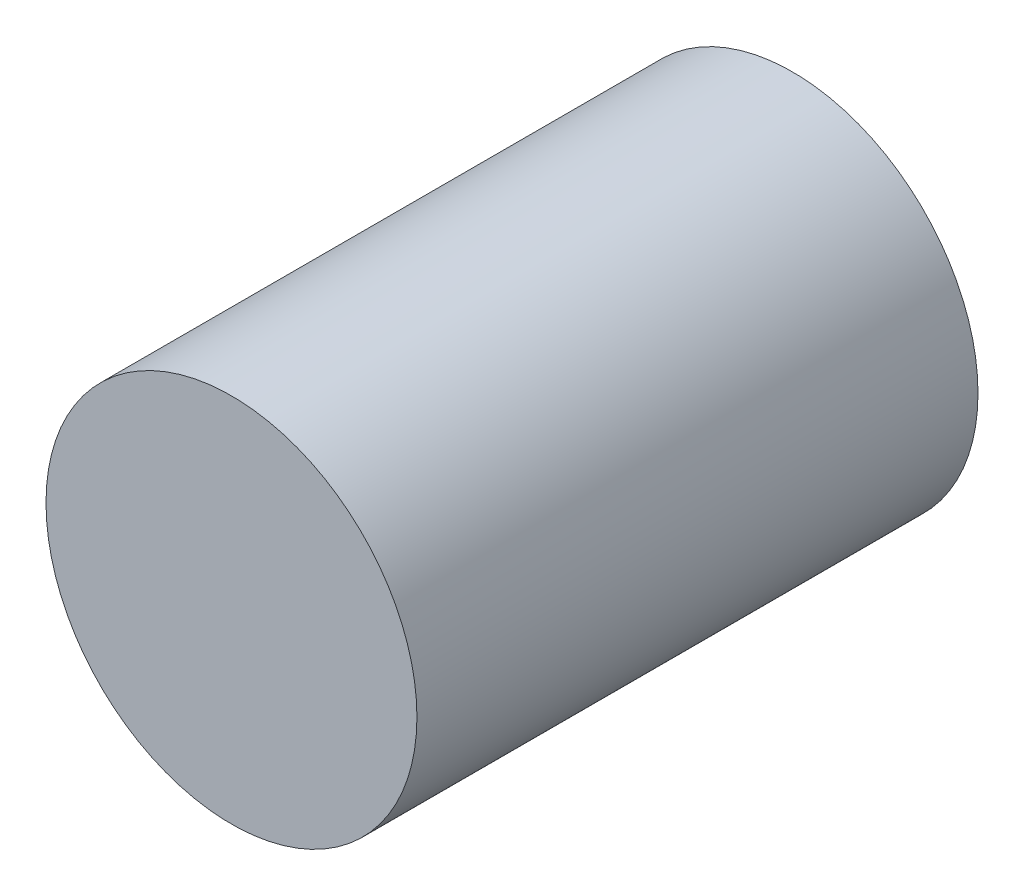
ISO-10303-21;
HEADER;
FILE_DESCRIPTION(('STEP AP214'),'2;1');
FILE_NAME('part.step','',(''),(''),'','','');
FILE_SCHEMA(('AUTOMOTIVE_DESIGN { 1 0 10303 214 1 1 1 1 }'));
ENDSEC;
DATA;
#1=APPLICATION_CONTEXT('core data for automotive mechanical design processes');
#2=APPLICATION_PROTOCOL_DEFINITION('international standard','automotive_design',2000,#1);
#3=PRODUCT_CONTEXT('',#1,'mechanical');
#4=PRODUCT('Part','Part','',(#3));
#5=PRODUCT_RELATED_PRODUCT_CATEGORY('part','',(#4));
#6=PRODUCT_DEFINITION_FORMATION('','',#4);
#7=PRODUCT_DEFINITION_CONTEXT('part definition',#1,'design');
#8=PRODUCT_DEFINITION('design','',#6,#7);
#9=PRODUCT_DEFINITION_SHAPE('','',#8);
#10=(LENGTH_UNIT() NAMED_UNIT(*) SI_UNIT(.MILLI.,.METRE.));
#11=(NAMED_UNIT(*) PLANE_ANGLE_UNIT() SI_UNIT($,.RADIAN.));
#12=(NAMED_UNIT(*) SI_UNIT($,.STERADIAN.) SOLID_ANGLE_UNIT());
#13=UNCERTAINTY_MEASURE_WITH_UNIT(LENGTH_MEASURE(1.E-05),#10,'distance_accuracy_value','');
#14=(GEOMETRIC_REPRESENTATION_CONTEXT(3) GLOBAL_UNCERTAINTY_ASSIGNED_CONTEXT((#13)) GLOBAL_UNIT_ASSIGNED_CONTEXT((#10,
#11,#12)) REPRESENTATION_CONTEXT('',''));
#15=CARTESIAN_POINT('',(0.,0.,0.));
#16=DIRECTION('',(0.,0.,1.));
#17=DIRECTION('',(1.,0.,0.));
#18=AXIS2_PLACEMENT_3D('',#15,#16,#17);
#19=CARTESIAN_POINT('',(47.9910885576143,-2.8153832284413,12.1));
#20=DIRECTION('',(0.,0.,-1.));
#21=DIRECTION('',(-1.,0.,0.));
#22=AXIS2_PLACEMENT_3D('',#19,#20,#21);
#23=CYLINDRICAL_SURFACE('',#22,4.00000000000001);
#24=CARTESIAN_POINT('',(47.9910885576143,-2.8153832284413,12.1));
#25=DIRECTION('',(0.,0.,1.));
#26=DIRECTION('',(1.,0.,0.));
#27=AXIS2_PLACEMENT_3D('',#24,#25,#26);
#28=CIRCLE('',#27,4.00000000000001);
#29=CARTESIAN_POINT('',(51.9910885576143,-2.8153832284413,12.1));
#30=VERTEX_POINT('',#29);
#31=EDGE_CURVE('E10',#30,#30,#28,.T.);
#32=ORIENTED_EDGE('',*,*,#31,.F.);
#33=EDGE_LOOP('',(#32));
#34=FACE_BOUND('',#33,.T.);
#35=CARTESIAN_POINT('',(47.9910885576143,-2.8153832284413,0.));
#36=DIRECTION('',(0.,0.,1.));
#37=DIRECTION('',(1.,0.,0.));
#38=AXIS2_PLACEMENT_3D('',#35,#36,#37);
#39=CIRCLE('',#38,4.00000000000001);
#40=CARTESIAN_POINT('',(51.9910885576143,-2.8153832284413,0.));
#41=VERTEX_POINT('',#40);
#42=EDGE_CURVE('E33',#41,#41,#39,.T.);
#43=ORIENTED_EDGE('',*,*,#42,.T.);
#44=EDGE_LOOP('',(#43));
#45=FACE_BOUND('',#44,.T.);
#46=ADVANCED_FACE('F30',(#34,#45),#23,.T.);
#47=CARTESIAN_POINT('',(47.9910885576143,-2.8153832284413,12.1));
#48=DIRECTION('',(0.,0.,1.));
#49=DIRECTION('',(1.,0.,0.));
#50=AXIS2_PLACEMENT_3D('',#47,#48,#49);
#51=PLANE('',#50);
#52=ORIENTED_EDGE('',*,*,#31,.T.);
#53=EDGE_LOOP('',(#52));
#54=FACE_BOUND('',#53,.T.);
#55=ADVANCED_FACE('F45',(#54),#51,.T.);
#56=CARTESIAN_POINT('',(47.9910885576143,-2.8153832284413,0.));
#57=DIRECTION('',(0.,0.,1.));
#58=DIRECTION('',(1.,0.,0.));
#59=AXIS2_PLACEMENT_3D('',#56,#57,#58);
#60=PLANE('',#59);
#61=ORIENTED_EDGE('',*,*,#42,.F.);
#62=EDGE_LOOP('',(#61));
#63=FACE_BOUND('',#62,.T.);
#64=ADVANCED_FACE('F43',(#63),#60,.F.);
#65=CLOSED_SHELL('',(#46,#55,#64));
#66=MANIFOLD_SOLID_BREP('B2',#65);
#67=ADVANCED_BREP_SHAPE_REPRESENTATION('',(#18,#66),#14);
#68=SHAPE_DEFINITION_REPRESENTATION(#9,#67);
ENDSEC;
END-ISO-10303-21;
